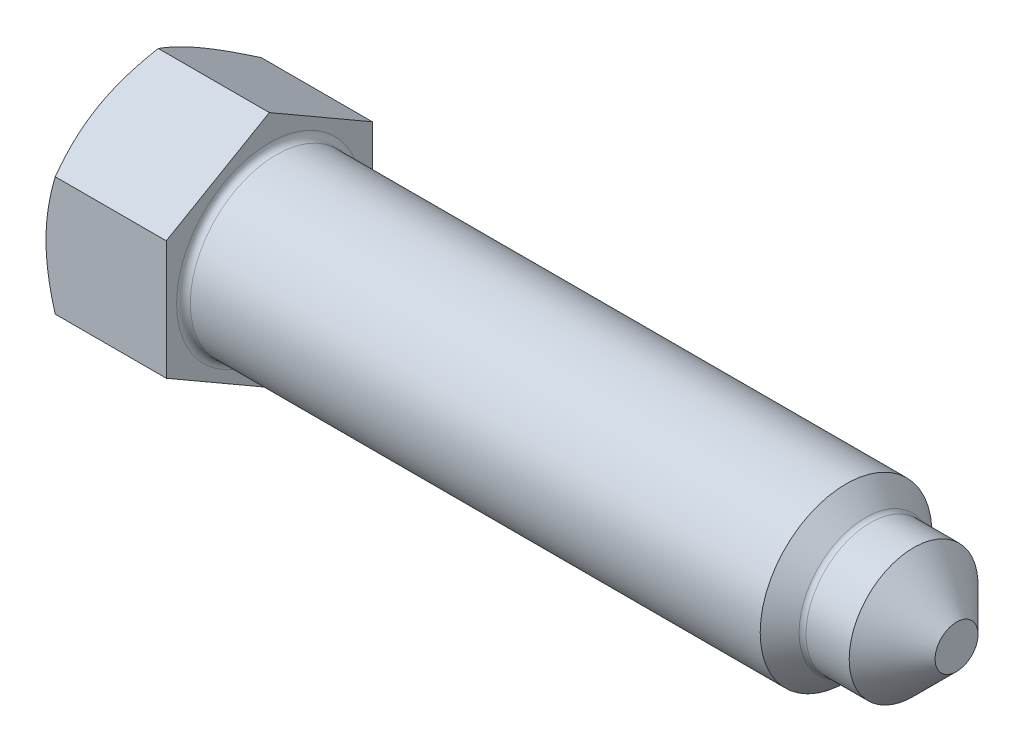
ISO-10303-21;
HEADER;
FILE_DESCRIPTION(('STEP AP214'),'2;1');
FILE_NAME('part.step','',(''),(''),'','','');
FILE_SCHEMA(('AUTOMOTIVE_DESIGN { 1 0 10303 214 1 1 1 1 }'));
ENDSEC;
DATA;
#1=APPLICATION_CONTEXT('core data for automotive mechanical design processes');
#2=APPLICATION_PROTOCOL_DEFINITION('international standard','automotive_design',2000,#1);
#3=PRODUCT_CONTEXT('',#1,'mechanical');
#4=PRODUCT('Part','Part','',(#3));
#5=PRODUCT_RELATED_PRODUCT_CATEGORY('part','',(#4));
#6=PRODUCT_DEFINITION_FORMATION('','',#4);
#7=PRODUCT_DEFINITION_CONTEXT('part definition',#1,'design');
#8=PRODUCT_DEFINITION('design','',#6,#7);
#9=PRODUCT_DEFINITION_SHAPE('','',#8);
#10=(LENGTH_UNIT() NAMED_UNIT(*) SI_UNIT(.MILLI.,.METRE.));
#11=(NAMED_UNIT(*) PLANE_ANGLE_UNIT() SI_UNIT($,.RADIAN.));
#12=(NAMED_UNIT(*) SI_UNIT($,.STERADIAN.) SOLID_ANGLE_UNIT());
#13=UNCERTAINTY_MEASURE_WITH_UNIT(LENGTH_MEASURE(1.E-05),#10,'distance_accuracy_value','');
#14=(GEOMETRIC_REPRESENTATION_CONTEXT(3) GLOBAL_UNCERTAINTY_ASSIGNED_CONTEXT((#13)) GLOBAL_UNIT_ASSIGNED_CONTEXT((#10,
#11,#12)) REPRESENTATION_CONTEXT('',''));
#15=CARTESIAN_POINT('',(0.,0.,0.));
#16=DIRECTION('',(0.,0.,1.));
#17=DIRECTION('',(1.,0.,0.));
#18=AXIS2_PLACEMENT_3D('',#15,#16,#17);
#19=CARTESIAN_POINT('',(14.,6.9282032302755,-12.));
#20=DIRECTION('',(0.,-0.866025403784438,0.500000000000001));
#21=DIRECTION('',(0.,-0.500000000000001,-0.866025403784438));
#22=AXIS2_PLACEMENT_3D('',#19,#20,#21);
#23=PLANE('',#22);
#24=CARTESIAN_POINT('',(1.07186343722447,13.8565219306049,0.0002));
#25=CARTESIAN_POINT('',(0.983949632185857,13.7042251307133,-0.263585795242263));
#26=CARTESIAN_POINT('',(0.900025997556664,13.5513604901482,-0.5283551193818));
#27=CARTESIAN_POINT('',(0.741266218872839,13.244405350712,-1.06001701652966));
#28=CARTESIAN_POINT('',(0.666433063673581,13.0903144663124,-1.32691025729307));
#29=CARTESIAN_POINT('',(0.457017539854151,12.6255589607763,-2.13189040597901));
#30=CARTESIAN_POINT('',(0.33790323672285,12.3130596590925,-2.6731550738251));
#31=CARTESIAN_POINT('',(0.198231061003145,11.8454187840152,-3.48313282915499));
#32=CARTESIAN_POINT('',(0.158443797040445,11.6916742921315,-3.74942610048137));
#33=CARTESIAN_POINT('',(0.091723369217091,11.3834734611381,-4.28324559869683));
#34=CARTESIAN_POINT('',(0.0647904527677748,11.2290171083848,-4.55077184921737));
#35=CARTESIAN_POINT('',(0.0244685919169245,10.9198468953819,-5.08627036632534));
#36=CARTESIAN_POINT('',(0.0110635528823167,10.7651335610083,-5.35424172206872));
#37=CARTESIAN_POINT('',(-0.00191690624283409,10.4555635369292,-5.89043273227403));
#38=CARTESIAN_POINT('',(-0.00149275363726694,10.3007068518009,-6.15865237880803));
#39=CARTESIAN_POINT('',(0.0122200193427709,10.011202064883,-6.6600893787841));
#40=CARTESIAN_POINT('',(0.0238359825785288,9.87653331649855,-6.89334249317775));
#41=CARTESIAN_POINT('',(0.0573080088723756,9.60750555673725,-7.35931224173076));
#42=CARTESIAN_POINT('',(0.0791647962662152,9.47314656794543,-7.59202883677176));
#43=CARTESIAN_POINT('',(0.132737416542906,9.20481134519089,-8.05679907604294));
#44=CARTESIAN_POINT('',(0.16446139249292,9.07083551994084,-8.288852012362));
#45=CARTESIAN_POINT('',(0.237211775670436,8.80351197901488,-8.75186996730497));
#46=CARTESIAN_POINT('',(0.278238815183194,8.67016430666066,-8.98283491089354));
#47=CARTESIAN_POINT('',(0.416311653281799,8.2653799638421,-9.68394195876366));
#48=CARTESIAN_POINT('',(0.52712488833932,7.99511549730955,-10.1520537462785));
#49=CARTESIAN_POINT('',(0.778625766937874,7.45861659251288,-11.0812971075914));
#50=CARTESIAN_POINT('',(0.919254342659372,7.19237528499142,-11.5424405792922));
#51=CARTESIAN_POINT('',(1.07186343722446,6.92808776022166,-12.0002));
#52=B_SPLINE_CURVE_WITH_KNOTS('',3,(#24,#25,#26,#27,#28,#29,#30,#31,#32,#33,#34,#35,#36,#37,#38,
#39,#40,#41,#42,#43,#44,#45,#46,#47,#48,#49,#50,#51),.UNSPECIFIED.,.F.,.F.,(4,2,2,2,2,2,2,2,2,2,
2,2,2,4),(0.,0.951004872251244,1.90232158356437,3.80900466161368,4.7389455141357,
5.66890426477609,6.59775529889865,7.5265776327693,8.33514643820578,9.14377244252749,
9.95306755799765,10.7624176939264,12.4167102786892,14.0677556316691),.UNSPECIFIED.);
#53=CARTESIAN_POINT('',(1.07179676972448,13.856406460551,0.));
#54=VERTEX_POINT('',#53);
#55=CARTESIAN_POINT('',(0.,10.3923048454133,-6.00000000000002));
#56=VERTEX_POINT('',#55);
#57=EDGE_CURVE('E48',#54,#56,#52,.T.);
#58=ORIENTED_EDGE('',*,*,#57,.F.);
#59=DIRECTION('',(-1.,0.,0.));
#60=VECTOR('',#59,1.);
#61=CARTESIAN_POINT('',(14.,13.856406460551,0.));
#62=LINE('',#61,#60);
#63=CARTESIAN_POINT('',(14.,13.856406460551,0.));
#64=VERTEX_POINT('',#63);
#65=EDGE_CURVE('E147',#64,#54,#62,.T.);
#66=ORIENTED_EDGE('',*,*,#65,.F.);
#67=DIRECTION('',(0.,0.500000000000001,0.866025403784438));
#68=VECTOR('',#67,1.);
#69=CARTESIAN_POINT('',(14.,6.9282032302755,-12.));
#70=LINE('',#69,#68);
#71=CARTESIAN_POINT('',(14.,6.9282032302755,-12.));
#72=VERTEX_POINT('',#71);
#73=EDGE_CURVE('E313',#72,#64,#70,.T.);
#74=ORIENTED_EDGE('',*,*,#73,.F.);
#75=DIRECTION('',(-1.,0.,0.));
#76=VECTOR('',#75,1.);
#77=CARTESIAN_POINT('',(14.,6.9282032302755,-12.));
#78=LINE('',#77,#76);
#79=CARTESIAN_POINT('',(1.07179676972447,6.9282032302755,-12.));
#80=VERTEX_POINT('',#79);
#81=EDGE_CURVE('E134',#72,#80,#78,.T.);
#82=ORIENTED_EDGE('',*,*,#81,.T.);
#83=EDGE_CURVE('E128',#56,#80,#52,.T.);
#84=ORIENTED_EDGE('',*,*,#83,.F.);
#85=EDGE_LOOP('',(#58,#66,#74,#82,#84));
#86=FACE_BOUND('',#85,.T.);
#87=ADVANCED_FACE('F33',(#86),#23,.F.);
#88=CARTESIAN_POINT('',(14.,13.856406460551,0.));
#89=DIRECTION('',(0.,-0.866025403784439,-0.5));
#90=DIRECTION('',(0.,0.5,-0.866025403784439));
#91=AXIS2_PLACEMENT_3D('',#88,#89,#90);
#92=PLANE('',#91);
#93=CARTESIAN_POINT('',(1.07186343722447,6.92808776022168,12.0002));
#94=CARTESIAN_POINT('',(0.983949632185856,7.0803845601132,11.7364142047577));
#95=CARTESIAN_POINT('',(0.900025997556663,7.23324920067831,11.4716448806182));
#96=CARTESIAN_POINT('',(0.741266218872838,7.5402043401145,10.9399829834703));
#97=CARTESIAN_POINT('',(0.666433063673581,7.69429522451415,10.6730897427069));
#98=CARTESIAN_POINT('',(0.457017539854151,8.15905073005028,9.86810959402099));
#99=CARTESIAN_POINT('',(0.337903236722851,8.47155003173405,9.3268449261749));
#100=CARTESIAN_POINT('',(0.198231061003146,8.93919090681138,8.51686717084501));
#101=CARTESIAN_POINT('',(0.158443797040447,9.09293539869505,8.25057389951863));
#102=CARTESIAN_POINT('',(0.0917233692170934,9.40113622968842,7.71675440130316));
#103=CARTESIAN_POINT('',(0.0647904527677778,9.55559258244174,7.44922815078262));
#104=CARTESIAN_POINT('',(0.024468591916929,9.86476279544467,6.91372963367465));
#105=CARTESIAN_POINT('',(0.0110635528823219,10.0194761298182,6.64575827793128));
#106=CARTESIAN_POINT('',(-0.00191690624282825,10.3290461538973,6.10956726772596));
#107=CARTESIAN_POINT('',(-0.00149275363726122,10.4839028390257,5.84134762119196));
#108=CARTESIAN_POINT('',(0.0122200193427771,10.7734076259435,5.3399106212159));
#109=CARTESIAN_POINT('',(0.0238359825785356,10.908076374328,5.10665750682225));
#110=CARTESIAN_POINT('',(0.057308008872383,11.1771041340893,4.64068775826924));
#111=CARTESIAN_POINT('',(0.0791647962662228,11.3114631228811,4.40797116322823));
#112=CARTESIAN_POINT('',(0.132737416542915,11.5797983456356,3.94320092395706));
#113=CARTESIAN_POINT('',(0.164461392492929,11.7137741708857,3.711147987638));
#114=CARTESIAN_POINT('',(0.237211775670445,11.9810977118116,3.24813003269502));
#115=CARTESIAN_POINT('',(0.278238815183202,12.1144453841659,3.01716508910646));
#116=CARTESIAN_POINT('',(0.416311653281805,12.5192297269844,2.31605804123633));
#117=CARTESIAN_POINT('',(0.527124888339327,12.789494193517,1.84794625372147));
#118=CARTESIAN_POINT('',(0.778625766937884,13.3259930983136,0.91870289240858));
#119=CARTESIAN_POINT('',(0.919254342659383,13.5922344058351,0.457559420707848));
#120=CARTESIAN_POINT('',(1.07186343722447,13.8565219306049,-0.000199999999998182));
#121=B_SPLINE_CURVE_WITH_KNOTS('',3,(#93,#94,#95,#96,#97,#98,#99,#100,#101,#102,#103,#104,#105,
#106,#107,#108,#109,#110,#111,#112,#113,#114,#115,#116,#117,#118,#119,#120),.UNSPECIFIED.,.F.,
.F.,(4,2,2,2,2,2,2,2,2,2,2,2,2,4),(0.,0.951004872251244,1.90232158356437,3.80900466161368,
4.7389455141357,5.66890426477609,6.59775529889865,7.5265776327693,8.33514643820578,
9.14377244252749,9.95306755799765,10.7624176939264,12.4167102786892,14.0677556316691),.UNSPECIFIED.);
#122=CARTESIAN_POINT('',(1.07179676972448,6.92820323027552,12.));
#123=VERTEX_POINT('',#122);
#124=CARTESIAN_POINT('',(0.,10.3923048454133,6.));
#125=VERTEX_POINT('',#124);
#126=EDGE_CURVE('E56',#123,#125,#121,.T.);
#127=ORIENTED_EDGE('',*,*,#126,.F.);
#128=DIRECTION('',(-1.,0.,0.));
#129=VECTOR('',#128,1.);
#130=CARTESIAN_POINT('',(14.,6.92820323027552,12.));
#131=LINE('',#130,#129);
#132=CARTESIAN_POINT('',(14.,6.92820323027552,12.));
#133=VERTEX_POINT('',#132);
#134=EDGE_CURVE('E144',#133,#123,#131,.T.);
#135=ORIENTED_EDGE('',*,*,#134,.F.);
#136=DIRECTION('',(0.,-0.5,0.866025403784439));
#137=VECTOR('',#136,1.);
#138=CARTESIAN_POINT('',(14.,13.856406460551,0.));
#139=LINE('',#138,#137);
#140=EDGE_CURVE('E299',#64,#133,#139,.T.);
#141=ORIENTED_EDGE('',*,*,#140,.F.);
#142=ORIENTED_EDGE('',*,*,#65,.T.);
#143=EDGE_CURVE('E226',#125,#54,#121,.T.);
#144=ORIENTED_EDGE('',*,*,#143,.F.);
#145=EDGE_LOOP('',(#127,#135,#141,#142,#144));
#146=FACE_BOUND('',#145,.T.);
#147=ADVANCED_FACE('F174',(#146),#92,.F.);
#148=CARTESIAN_POINT('',(14.,6.92820323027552,12.));
#149=DIRECTION('',(0.,0.,-1.));
#150=DIRECTION('',(-1.,0.,0.));
#151=AXIS2_PLACEMENT_3D('',#148,#149,#150);
#152=PLANE('',#151);
#153=CARTESIAN_POINT('',(5.93796522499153,-18.7780422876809,12.));
#154=CARTESIAN_POINT('',(5.81013580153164,-18.5152821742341,12.));
#155=CARTESIAN_POINT('',(5.68293119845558,-18.2522182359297,12.));
#156=CARTESIAN_POINT('',(5.4299128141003,-17.7254193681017,12.));
#157=CARTESIAN_POINT('',(5.30409904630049,-17.4616844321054,12.));
#158=CARTESIAN_POINT('',(4.92892368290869,-16.6693101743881,12.));
#159=CARTESIAN_POINT('',(4.68186469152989,-16.1395765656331,12.));
#160=CARTESIAN_POINT('',(4.19405479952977,-15.0738169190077,12.));
#161=CARTESIAN_POINT('',(3.95334413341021,-14.5377724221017,12.));
#162=CARTESIAN_POINT('',(3.48154718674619,-13.461479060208,12.));
#163=CARTESIAN_POINT('',(3.25046046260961,-12.9212303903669,12.));
#164=CARTESIAN_POINT('',(2.79294900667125,-11.8175688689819,12.));
#165=CARTESIAN_POINT('',(2.56693655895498,-11.2539842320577,12.));
#166=CARTESIAN_POINT('',(2.1316128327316,-10.1202797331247,12.));
#167=CARTESIAN_POINT('',(1.92230340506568,-9.55015915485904,12.));
#168=CARTESIAN_POINT('',(1.52576124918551,-8.40350794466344,12.));
#169=CARTESIAN_POINT('',(1.33848523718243,-7.82699240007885,12.));
#170=CARTESIAN_POINT('',(0.991896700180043,-6.66563869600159,12.));
#171=CARTESIAN_POINT('',(0.832575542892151,-6.08080316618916,12.));
#172=CARTESIAN_POINT('',(0.620681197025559,-5.19882791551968,12.));
#173=CARTESIAN_POINT('',(0.554713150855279,-4.90488790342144,12.));
#174=CARTESIAN_POINT('',(0.432574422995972,-4.31496880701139,12.));
#175=CARTESIAN_POINT('',(0.376403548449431,-4.01898976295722,12.));
#176=CARTESIAN_POINT('',(0.274840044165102,-3.42518449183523,12.));
#177=CARTESIAN_POINT('',(0.229447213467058,-3.12735829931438,12.));
#178=CARTESIAN_POINT('',(0.150338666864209,-2.5301603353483,12.));
#179=CARTESIAN_POINT('',(0.116622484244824,-2.23078862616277,12.));
#180=CARTESIAN_POINT('',(0.0619693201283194,-1.63489952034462,12.));
#181=CARTESIAN_POINT('',(0.0408679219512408,-1.33839729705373,12.));
#182=CARTESIAN_POINT('',(0.011231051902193,-0.744766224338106,12.));
#183=CARTESIAN_POINT('',(0.00269536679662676,-0.447637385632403,12.));
#184=CARTESIAN_POINT('',(-0.00160621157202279,0.146715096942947,12.));
#185=CARTESIAN_POINT('',(0.00262788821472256,0.443938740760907,12.));
#186=CARTESIAN_POINT('',(0.0237602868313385,1.03793867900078,12.));
#187=CARTESIAN_POINT('',(0.0406591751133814,1.33471495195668,12.));
#188=CARTESIAN_POINT('',(0.0957363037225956,2.04293812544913,12.));
#189=CARTESIAN_POINT('',(0.139644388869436,2.45394931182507,12.));
#190=CARTESIAN_POINT('',(0.249393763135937,3.27301119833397,12.));
#191=CARTESIAN_POINT('',(0.315237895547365,3.68106150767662,12.));
#192=CARTESIAN_POINT('',(0.542190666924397,4.90025554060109,12.));
#193=CARTESIAN_POINT('',(0.732681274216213,5.70600726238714,12.));
#194=CARTESIAN_POINT('',(1.06415793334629,6.9110176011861,12.));
#195=CARTESIAN_POINT('',(1.18384338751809,7.31649624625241,12.));
#196=CARTESIAN_POINT('',(1.43593551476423,8.12351840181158,12.));
#197=CARTESIAN_POINT('',(1.56834227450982,8.52506188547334,12.));
#198=CARTESIAN_POINT('',(1.84372865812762,9.32433402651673,12.));
#199=CARTESIAN_POINT('',(1.98670500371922,9.72206382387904,12.));
#200=CARTESIAN_POINT('',(2.28151949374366,10.514209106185,12.));
#201=CARTESIAN_POINT('',(2.43335751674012,10.9086246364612,12.));
#202=CARTESIAN_POINT('',(2.81137815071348,11.8636440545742,12.));
#203=CARTESIAN_POINT('',(3.04143185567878,12.4227131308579,12.));
#204=CARTESIAN_POINT('',(3.51333410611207,13.5358669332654,12.));
#205=CARTESIAN_POINT('',(3.75518348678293,14.0899513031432,12.));
#206=CARTESIAN_POINT('',(4.24823475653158,15.1941025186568,12.));
#207=CARTESIAN_POINT('',(4.49943904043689,15.7441682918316,12.));
#208=CARTESIAN_POINT('',(5.00924552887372,16.840834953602,12.));
#209=CARTESIAN_POINT('',(5.26784754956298,17.38743592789,12.));
#210=CARTESIAN_POINT('',(5.79133879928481,18.4784293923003,12.));
#211=CARTESIAN_POINT('',(6.05623527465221,19.0228183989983,12.));
#212=CARTESIAN_POINT('',(6.59090796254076,20.1091945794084,12.));
#213=CARTESIAN_POINT('',(6.86068419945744,20.651181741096,12.));
#214=CARTESIAN_POINT('',(7.40421496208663,21.7330545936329,12.));
#215=CARTESIAN_POINT('',(7.67796889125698,22.2729405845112,12.));
#216=CARTESIAN_POINT('',(8.22882461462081,23.351002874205,12.));
#217=CARTESIAN_POINT('',(8.50592642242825,23.8891791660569,12.));
#218=CARTESIAN_POINT('',(9.29226596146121,25.4066579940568,12.));
#219=CARTESIAN_POINT('',(9.8047565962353,26.3842748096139,12.));
#220=CARTESIAN_POINT('',(10.8366490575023,28.3358962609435,12.));
#221=CARTESIAN_POINT('',(11.3560511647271,29.3099007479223,12.));
#222=CARTESIAN_POINT('',(12.3986980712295,31.2524398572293,12.));
#223=CARTESIAN_POINT('',(12.9219285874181,32.2209821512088,12.));
#224=CARTESIAN_POINT('',(13.709817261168,33.6721037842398,12.));
#225=CARTESIAN_POINT('',(13.9729461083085,34.1555146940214,12.));
#226=CARTESIAN_POINT('',(14.5001155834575,35.1218381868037,12.));
#227=CARTESIAN_POINT('',(14.7641562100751,35.6047507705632,12.));
#228=CARTESIAN_POINT('',(15.0285993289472,36.087442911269,12.));
#229=B_SPLINE_CURVE_WITH_KNOTS('',3,(#153,#154,#155,#156,#157,#158,#159,#160,#161,#162,#163,
#164,#165,#166,#167,#168,#169,#170,#171,#172,#173,#174,#175,#176,#177,#178,#179,#180,#181,#182,
#183,#184,#185,#186,#187,#188,#189,#190,#191,#192,#193,#194,#195,#196,#197,#198,#199,#200,#201,
#202,#203,#204,#205,#206,#207,#208,#209,#210,#211,#212,#213,#214,#215,#216,#217,#218,#219,#220,
#221,#222,#223,#224,#225,#226,#227,#228),.UNSPECIFIED.,.F.,.F.,(4,2,2,2,2,2,2,2,2,2,2,2,2,2,2,2,
2,2,2,2,2,2,2,2,2,2,2,2,2,2,2,2,2,2,2,2,2,4),(0.,0.876610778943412,1.75323004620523,
3.50671945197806,5.26947518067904,7.03214956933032,8.85359042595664,10.6752328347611,
12.4932347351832,14.3106742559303,15.2142921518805,16.117892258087,17.0214755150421,
17.9250226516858,18.8165208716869,19.7080039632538,20.5994865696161,21.4910106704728,
22.7303633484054,23.9698767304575,26.4502079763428,27.7184187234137,28.9866381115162,
30.2544657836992,31.5222760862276,33.3357454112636,35.1493433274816,36.9634087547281,
38.7774291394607,40.5936500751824,42.4098800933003,44.2258404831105,46.0418082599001,
49.3531754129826,52.664677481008,55.9671781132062,57.6183303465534,59.2694800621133),.UNSPECIFIED.);
#230=CARTESIAN_POINT('',(1.07179676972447,-6.92820323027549,12.));
#231=VERTEX_POINT('',#230);
#232=CARTESIAN_POINT('',(0.,0.,12.));
#233=VERTEX_POINT('',#232);
#234=EDGE_CURVE('E237',#231,#233,#229,.T.);
#235=ORIENTED_EDGE('',*,*,#234,.F.);
#236=DIRECTION('',(-1.,0.,0.));
#237=VECTOR('',#236,1.);
#238=CARTESIAN_POINT('',(14.,-6.92820323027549,12.));
#239=LINE('',#238,#237);
#240=CARTESIAN_POINT('',(14.,-6.92820323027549,12.));
#241=VERTEX_POINT('',#240);
#242=EDGE_CURVE('E136',#241,#231,#239,.T.);
#243=ORIENTED_EDGE('',*,*,#242,.F.);
#244=DIRECTION('',(0.,-1.,0.));
#245=VECTOR('',#244,1.);
#246=CARTESIAN_POINT('',(14.,6.92820323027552,12.));
#247=LINE('',#246,#245);
#248=EDGE_CURVE('E298',#133,#241,#247,.T.);
#249=ORIENTED_EDGE('',*,*,#248,.F.);
#250=ORIENTED_EDGE('',*,*,#134,.T.);
#251=EDGE_CURVE('E231',#233,#123,#229,.T.);
#252=ORIENTED_EDGE('',*,*,#251,.F.);
#253=EDGE_LOOP('',(#235,#243,#249,#250,#252));
#254=FACE_BOUND('',#253,.T.);
#255=ADVANCED_FACE('F180',(#254),#152,.F.);
#256=CARTESIAN_POINT('',(14.,-13.856406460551,0.));
#257=DIRECTION('',(0.,0.866025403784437,-0.500000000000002));
#258=DIRECTION('',(0.,0.500000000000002,0.866025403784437));
#259=AXIS2_PLACEMENT_3D('',#256,#257,#258);
#260=PLANE('',#259);
#261=CARTESIAN_POINT('',(1.07186343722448,-13.8565219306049,-0.000200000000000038));
#262=CARTESIAN_POINT('',(0.983949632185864,-13.7042251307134,0.263585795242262));
#263=CARTESIAN_POINT('',(0.900025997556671,-13.5513604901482,0.528355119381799));
#264=CARTESIAN_POINT('',(0.741266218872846,-13.2444053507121,1.06001701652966));
#265=CARTESIAN_POINT('',(0.666433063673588,-13.0903144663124,1.32691025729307));
#266=CARTESIAN_POINT('',(0.457017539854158,-12.6255589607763,2.13189040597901));
#267=CARTESIAN_POINT('',(0.337903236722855,-12.3130596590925,2.6731550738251));
#268=CARTESIAN_POINT('',(0.198231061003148,-11.8454187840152,3.48313282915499));
#269=CARTESIAN_POINT('',(0.158443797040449,-11.6916742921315,3.74942610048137));
#270=CARTESIAN_POINT('',(0.0917233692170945,-11.3834734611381,4.28324559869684));
#271=CARTESIAN_POINT('',(0.0647904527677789,-11.2290171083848,4.55077184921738));
#272=CARTESIAN_POINT('',(0.0244685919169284,-10.9198468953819,5.08627036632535));
#273=CARTESIAN_POINT('',(0.0110635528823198,-10.7651335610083,5.35424172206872));
#274=CARTESIAN_POINT('',(-0.00191690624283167,-10.4555635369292,5.89043273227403));
#275=CARTESIAN_POINT('',(-0.0014927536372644,-10.3007068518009,6.15865237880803));
#276=CARTESIAN_POINT('',(0.0122200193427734,-10.0112020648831,6.6600893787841));
#277=CARTESIAN_POINT('',(0.0238359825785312,-9.87653331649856,6.89334249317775));
#278=CARTESIAN_POINT('',(0.0573080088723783,-9.60750555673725,7.35931224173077));
#279=CARTESIAN_POINT('',(0.0791647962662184,-9.47314656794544,7.59202883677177));
#280=CARTESIAN_POINT('',(0.132737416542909,-9.2048113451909,8.05679907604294));
#281=CARTESIAN_POINT('',(0.164461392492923,-9.07083551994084,8.288852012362));
#282=CARTESIAN_POINT('',(0.237211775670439,-8.80351197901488,8.75186996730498));
#283=CARTESIAN_POINT('',(0.278238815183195,-8.67016430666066,8.98283491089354));
#284=CARTESIAN_POINT('',(0.416311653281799,-8.2653799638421,9.68394195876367));
#285=CARTESIAN_POINT('',(0.52712488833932,-7.99511549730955,10.1520537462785));
#286=CARTESIAN_POINT('',(0.778625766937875,-7.45861659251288,11.0812971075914));
#287=CARTESIAN_POINT('',(0.919254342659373,-7.19237528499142,11.5424405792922));
#288=CARTESIAN_POINT('',(1.07186343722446,-6.92808776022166,12.0002));
#289=B_SPLINE_CURVE_WITH_KNOTS('',3,(#261,#262,#263,#264,#265,#266,#267,#268,#269,#270,#271,
#272,#273,#274,#275,#276,#277,#278,#279,#280,#281,#282,#283,#284,#285,#286,#287,#288),
.UNSPECIFIED.,.F.,.F.,(4,2,2,2,2,2,2,2,2,2,2,2,2,4),(0.,0.951004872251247,1.90232158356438,
3.80900466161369,4.7389455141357,5.66890426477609,6.59775529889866,7.52657763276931,
8.33514643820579,9.1437724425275,9.95306755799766,10.7624176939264,12.4167102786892,
14.0677556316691),.UNSPECIFIED.);
#290=CARTESIAN_POINT('',(1.07179676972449,-13.856406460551,0.));
#291=VERTEX_POINT('',#290);
#292=CARTESIAN_POINT('',(0.,-10.3923048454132,6.00000000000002));
#293=VERTEX_POINT('',#292);
#294=EDGE_CURVE('E198',#291,#293,#289,.T.);
#295=ORIENTED_EDGE('',*,*,#294,.F.);
#296=DIRECTION('',(-1.,0.,0.));
#297=VECTOR('',#296,1.);
#298=CARTESIAN_POINT('',(14.,-13.856406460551,0.));
#299=LINE('',#298,#297);
#300=CARTESIAN_POINT('',(14.,-13.856406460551,0.));
#301=VERTEX_POINT('',#300);
#302=EDGE_CURVE('E133',#301,#291,#299,.T.);
#303=ORIENTED_EDGE('',*,*,#302,.F.);
#304=DIRECTION('',(0.,-0.500000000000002,-0.866025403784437));
#305=VECTOR('',#304,1.);
#306=CARTESIAN_POINT('',(14.,-13.856406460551,0.));
#307=LINE('',#306,#305);
#308=EDGE_CURVE('E307',#241,#301,#307,.T.);
#309=ORIENTED_EDGE('',*,*,#308,.F.);
#310=ORIENTED_EDGE('',*,*,#242,.T.);
#311=EDGE_CURVE('E238',#293,#231,#289,.T.);
#312=ORIENTED_EDGE('',*,*,#311,.F.);
#313=EDGE_LOOP('',(#295,#303,#309,#310,#312));
#314=FACE_BOUND('',#313,.T.);
#315=ADVANCED_FACE('F243',(#314),#260,.F.);
#316=CARTESIAN_POINT('',(14.,-6.92820323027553,-12.));
#317=DIRECTION('',(0.,0.866025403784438,0.5));
#318=DIRECTION('',(0.,-0.5,0.866025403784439));
#319=AXIS2_PLACEMENT_3D('',#316,#317,#318);
#320=PLANE('',#319);
#321=CARTESIAN_POINT('',(1.07186343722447,-6.92808776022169,-12.0002));
#322=CARTESIAN_POINT('',(0.983949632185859,-7.08038456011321,-11.7364142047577));
#323=CARTESIAN_POINT('',(0.900025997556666,-7.23324920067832,-11.4716448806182));
#324=CARTESIAN_POINT('',(0.741266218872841,-7.54020434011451,-10.9399829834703));
#325=CARTESIAN_POINT('',(0.666433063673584,-7.69429522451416,-10.6730897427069));
#326=CARTESIAN_POINT('',(0.457017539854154,-8.15905073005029,-9.86810959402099));
#327=CARTESIAN_POINT('',(0.337903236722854,-8.47155003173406,-9.3268449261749));
#328=CARTESIAN_POINT('',(0.198231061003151,-8.93919090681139,-8.516867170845));
#329=CARTESIAN_POINT('',(0.158443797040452,-9.09293539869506,-8.25057389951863));
#330=CARTESIAN_POINT('',(0.0917233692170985,-9.40113622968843,-7.71675440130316));
#331=CARTESIAN_POINT('',(0.0647904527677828,-9.55559258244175,-7.44922815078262));
#332=CARTESIAN_POINT('',(0.024468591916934,-9.86476279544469,-6.91372963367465));
#333=CARTESIAN_POINT('',(0.011063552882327,-10.0194761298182,-6.64575827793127));
#334=CARTESIAN_POINT('',(-0.00191690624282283,-10.3290461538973,-6.10956726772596));
#335=CARTESIAN_POINT('',(-0.00149275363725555,-10.4839028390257,-5.84134762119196));
#336=CARTESIAN_POINT('',(0.0122200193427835,-10.7734076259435,-5.3399106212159));
#337=CARTESIAN_POINT('',(0.0238359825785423,-10.908076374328,-5.10665750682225));
#338=CARTESIAN_POINT('',(0.0573080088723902,-11.1771041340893,-4.64068775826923));
#339=CARTESIAN_POINT('',(0.07916479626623,-11.3114631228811,-4.40797116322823));
#340=CARTESIAN_POINT('',(0.132737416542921,-11.5797983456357,-3.94320092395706));
#341=CARTESIAN_POINT('',(0.164461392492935,-11.7137741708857,-3.711147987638));
#342=CARTESIAN_POINT('',(0.237211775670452,-11.9810977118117,-3.24813003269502));
#343=CARTESIAN_POINT('',(0.278238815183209,-12.1144453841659,-3.01716508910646));
#344=CARTESIAN_POINT('',(0.416311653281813,-12.5192297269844,-2.31605804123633));
#345=CARTESIAN_POINT('',(0.527124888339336,-12.789494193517,-1.84794625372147));
#346=CARTESIAN_POINT('',(0.778625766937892,-13.3259930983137,-0.918702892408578));
#347=CARTESIAN_POINT('',(0.91925434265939,-13.5922344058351,-0.457559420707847));
#348=CARTESIAN_POINT('',(1.07186343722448,-13.8565219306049,0.000199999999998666));
#349=B_SPLINE_CURVE_WITH_KNOTS('',3,(#321,#322,#323,#324,#325,#326,#327,#328,#329,#330,#331,
#332,#333,#334,#335,#336,#337,#338,#339,#340,#341,#342,#343,#344,#345,#346,#347,#348),
.UNSPECIFIED.,.F.,.F.,(4,2,2,2,2,2,2,2,2,2,2,2,2,4),(0.,0.951004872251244,1.90232158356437,
3.80900466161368,4.7389455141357,5.66890426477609,6.59775529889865,7.5265776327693,
8.33514643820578,9.14377244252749,9.95306755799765,10.7624176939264,12.4167102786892,
14.0677556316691),.UNSPECIFIED.);
#350=CARTESIAN_POINT('',(1.07179676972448,-6.92820323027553,-12.));
#351=VERTEX_POINT('',#350);
#352=CARTESIAN_POINT('',(0.,-10.3923048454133,-6.));
#353=VERTEX_POINT('',#352);
#354=EDGE_CURVE('E109',#351,#353,#349,.T.);
#355=ORIENTED_EDGE('',*,*,#354,.F.);
#356=DIRECTION('',(-1.,0.,0.));
#357=VECTOR('',#356,1.);
#358=CARTESIAN_POINT('',(14.,-6.92820323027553,-12.));
#359=LINE('',#358,#357);
#360=CARTESIAN_POINT('',(14.,-6.92820323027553,-12.));
#361=VERTEX_POINT('',#360);
#362=EDGE_CURVE('E124',#361,#351,#359,.T.);
#363=ORIENTED_EDGE('',*,*,#362,.F.);
#364=DIRECTION('',(0.,0.5,-0.866025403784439));
#365=VECTOR('',#364,1.);
#366=CARTESIAN_POINT('',(14.,-6.92820323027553,-12.));
#367=LINE('',#366,#365);
#368=EDGE_CURVE('E305',#301,#361,#367,.T.);
#369=ORIENTED_EDGE('',*,*,#368,.F.);
#370=ORIENTED_EDGE('',*,*,#302,.T.);
#371=EDGE_CURVE('E127',#353,#291,#349,.T.);
#372=ORIENTED_EDGE('',*,*,#371,.F.);
#373=EDGE_LOOP('',(#355,#363,#369,#370,#372));
#374=FACE_BOUND('',#373,.T.);
#375=ADVANCED_FACE('F122',(#374),#320,.F.);
#376=CARTESIAN_POINT('',(14.,6.9282032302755,-12.));
#377=DIRECTION('',(0.,0.,1.));
#378=DIRECTION('',(0.,-1.,0.));
#379=AXIS2_PLACEMENT_3D('',#376,#377,#378);
#380=PLANE('',#379);
#381=CARTESIAN_POINT('',(5.93796522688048,-18.7780422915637,-12.));
#382=CARTESIAN_POINT('',(5.81013580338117,-18.5152821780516,-12.));
#383=CARTESIAN_POINT('',(5.68293120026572,-18.2522182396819,-12.));
#384=CARTESIAN_POINT('',(5.42991281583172,-17.7254193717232,-12.));
#385=CARTESIAN_POINT('',(5.30409904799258,-17.4616844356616,-12.));
#386=CARTESIAN_POINT('',(4.92892368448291,-16.669310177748,-12.));
#387=CARTESIAN_POINT('',(4.68186469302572,-16.139576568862,-12.));
#388=CARTESIAN_POINT('',(4.19405480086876,-15.0738169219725,-12.));
#389=CARTESIAN_POINT('',(3.95334413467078,-14.5377724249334,-12.));
#390=CARTESIAN_POINT('',(3.48154718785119,-13.4614790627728,-12.));
#391=CARTESIAN_POINT('',(3.25046046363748,-12.9212303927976,-12.));
#392=CARTESIAN_POINT('',(2.7929490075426,-11.8175688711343,-12.));
#393=CARTESIAN_POINT('',(2.56693655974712,-11.2539842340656,-12.));
#394=CARTESIAN_POINT('',(2.13161283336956,-10.1202797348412,-12.));
#395=CARTESIAN_POINT('',(1.92230340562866,-9.55015915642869,-12.));
#396=CARTESIAN_POINT('',(1.52576124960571,-8.40350794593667,-12.));
#397=CARTESIAN_POINT('',(1.33848523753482,-7.82699240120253,-12.));
#398=CARTESIAN_POINT('',(0.991896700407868,-6.66563869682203,-12.));
#399=CARTESIAN_POINT('',(0.83257554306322,-6.08080316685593,-12.));
#400=CARTESIAN_POINT('',(0.620681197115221,-5.19882791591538,-12.));
#401=CARTESIAN_POINT('',(0.554713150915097,-4.90488790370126,-12.));
#402=CARTESIAN_POINT('',(0.432574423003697,-4.3149688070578,-12.));
#403=CARTESIAN_POINT('',(0.376403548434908,-4.01898976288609,-12.));
#404=CARTESIAN_POINT('',(0.274840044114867,-3.42518449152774,-12.));
#405=CARTESIAN_POINT('',(0.229447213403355,-3.12735829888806,-12.));
#406=CARTESIAN_POINT('',(0.150338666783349,-2.53016033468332,-12.));
#407=CARTESIAN_POINT('',(0.116622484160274,-2.23078862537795,-12.));
#408=CARTESIAN_POINT('',(0.0619693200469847,-1.63489951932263,-12.));
#409=CARTESIAN_POINT('',(0.040867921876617,-1.33839729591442,-12.));
#410=CARTESIAN_POINT('',(0.0112310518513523,-0.744766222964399,-12.));
#411=CARTESIAN_POINT('',(0.00269536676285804,-0.447637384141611,-12.));
#412=CARTESIAN_POINT('',(-0.00160621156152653,0.146715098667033,-12.));
#413=CARTESIAN_POINT('',(0.00262788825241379,0.443938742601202,-12.));
#414=CARTESIAN_POINT('',(0.0237602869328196,1.03793868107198,-12.));
#415=CARTESIAN_POINT('',(0.0406591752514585,1.33471495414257,-12.));
#416=CARTESIAN_POINT('',(0.0957363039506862,2.04293812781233,-12.));
#417=CARTESIAN_POINT('',(0.139644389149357,2.45394931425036,-12.));
#418=CARTESIAN_POINT('',(0.249393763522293,3.27301120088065,-12.));
#419=CARTESIAN_POINT('',(0.315237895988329,3.68106151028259,-12.));
#420=CARTESIAN_POINT('',(0.542190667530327,4.90025554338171,-12.));
#421=CARTESIAN_POINT('',(0.732681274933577,5.70600726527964,-12.));
#422=CARTESIAN_POINT('',(1.06415793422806,6.91101760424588,-12.));
#423=CARTESIAN_POINT('',(1.18384338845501,7.3164962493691,-12.));
#424=CARTESIAN_POINT('',(1.43593551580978,8.12351840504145,-12.));
#425=CARTESIAN_POINT('',(1.56834227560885,8.52506188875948,-12.));
#426=CARTESIAN_POINT('',(1.8437286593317,9.32433402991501,-12.));
#427=CARTESIAN_POINT('',(1.98670500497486,9.72206382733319,-12.));
#428=CARTESIAN_POINT('',(2.28151949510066,10.5142091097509,-12.));
#429=CARTESIAN_POINT('',(2.43335751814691,10.9086246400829,-12.));
#430=CARTESIAN_POINT('',(2.81137815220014,11.863644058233,-12.));
#431=CARTESIAN_POINT('',(3.04143185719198,12.422713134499,-12.));
#432=CARTESIAN_POINT('',(3.51333410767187,13.5358669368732,-12.));
#433=CARTESIAN_POINT('',(3.7551834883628,14.0899513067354,-12.));
#434=CARTESIAN_POINT('',(4.24823475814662,15.1941025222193,-12.));
#435=CARTESIAN_POINT('',(4.49943904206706,15.7441682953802,-12.));
#436=CARTESIAN_POINT('',(5.00924553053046,16.8408349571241,-12.));
#437=CARTESIAN_POINT('',(5.26784755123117,17.3874359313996,-12.));
#438=CARTESIAN_POINT('',(5.79133880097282,18.4784293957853,-12.));
#439=CARTESIAN_POINT('',(6.05623527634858,19.0228184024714,-12.));
#440=CARTESIAN_POINT('',(6.59090796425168,20.1091945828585,-12.));
#441=CARTESIAN_POINT('',(6.86068420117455,20.6511817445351,-12.));
#442=CARTESIAN_POINT('',(7.40421496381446,21.7330545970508,-12.));
#443=CARTESIAN_POINT('',(7.67796889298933,22.2729405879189,-12.));
#444=CARTESIAN_POINT('',(8.2288246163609,23.3510028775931,-12.));
#445=CARTESIAN_POINT('',(8.50592642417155,23.8891791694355,-12.));
#446=CARTESIAN_POINT('',(9.29226596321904,25.4066579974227,-12.));
#447=CARTESIAN_POINT('',(9.80475659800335,26.3842748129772,-12.));
#448=CARTESIAN_POINT('',(10.8366490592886,28.3358962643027,-12.));
#449=CARTESIAN_POINT('',(11.3560511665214,29.3099007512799,-12.));
#450=CARTESIAN_POINT('',(12.3986980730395,31.252439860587,-12.));
#451=CARTESIAN_POINT('',(12.9219285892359,32.2209821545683,-12.));
#452=CARTESIAN_POINT('',(13.7098172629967,33.6721037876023,-12.));
#453=CARTESIAN_POINT('',(13.9729461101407,34.155514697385,-12.));
#454=CARTESIAN_POINT('',(14.5001155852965,35.1218381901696,-12.));
#455=CARTESIAN_POINT('',(14.7641562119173,35.6047507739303,-12.));
#456=CARTESIAN_POINT('',(15.0285993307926,36.0874429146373,-12.));
#457=B_SPLINE_CURVE_WITH_KNOTS('',3,(#381,#382,#383,#384,#385,#386,#387,#388,#389,#390,#391,
#392,#393,#394,#395,#396,#397,#398,#399,#400,#401,#402,#403,#404,#405,#406,#407,#408,#409,#410,
#411,#412,#413,#414,#415,#416,#417,#418,#419,#420,#421,#422,#423,#424,#425,#426,#427,#428,#429,
#430,#431,#432,#433,#434,#435,#436,#437,#438,#439,#440,#441,#442,#443,#444,#445,#446,#447,#448,
#449,#450,#451,#452,#453,#454,#455,#456),.UNSPECIFIED.,.F.,.F.,(4,2,2,2,2,2,2,2,2,2,2,2,2,2,2,2,
2,2,2,2,2,2,2,2,2,2,2,2,2,2,2,2,2,2,2,2,2,4),(0.,0.876610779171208,1.75323004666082,
3.50671945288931,5.26947518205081,7.03214957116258,8.85359042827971,10.6752328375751,
12.4932347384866,14.3106742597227,15.2142921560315,16.1178922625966,17.02147551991,
17.9250226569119,18.8165208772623,19.7080039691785,20.5994865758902,21.4910106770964,
22.7303633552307,23.9698767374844,26.4502079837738,27.7184187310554,28.9866381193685,
30.2544657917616,31.5222760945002,33.3357454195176,35.1493433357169,36.9634087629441,
38.7774291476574,40.5936500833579,42.4098801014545,44.2258404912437,46.0418082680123,
49.3531754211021,52.6646774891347,55.9671781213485,57.6183303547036,59.2694800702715),.UNSPECIFIED.);
#458=CARTESIAN_POINT('',(0.,0.,-12.));
#459=VERTEX_POINT('',#458);
#460=EDGE_CURVE('E116',#80,#459,#457,.F.);
#461=ORIENTED_EDGE('',*,*,#460,.F.);
#462=ORIENTED_EDGE('',*,*,#81,.F.);
#463=DIRECTION('',(0.,1.,0.));
#464=VECTOR('',#463,1.);
#465=CARTESIAN_POINT('',(14.,6.9282032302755,-12.));
#466=LINE('',#465,#464);
#467=EDGE_CURVE('E132',#361,#72,#466,.T.);
#468=ORIENTED_EDGE('',*,*,#467,.F.);
#469=ORIENTED_EDGE('',*,*,#362,.T.);
#470=EDGE_CURVE('E106',#459,#351,#457,.F.);
#471=ORIENTED_EDGE('',*,*,#470,.F.);
#472=EDGE_LOOP('',(#461,#462,#468,#469,#471));
#473=FACE_BOUND('',#472,.T.);
#474=ADVANCED_FACE('F130',(#473),#380,.F.);
#475=CARTESIAN_POINT('',(14.,0.,-24.));
#476=DIRECTION('',(1.,0.,0.));
#477=DIRECTION('',(0.,0.,-1.));
#478=AXIS2_PLACEMENT_3D('',#475,#476,#477);
#479=PLANE('',#478);
#480=CARTESIAN_POINT('',(14.,0.,0.));
#481=DIRECTION('',(1.,0.,0.));
#482=DIRECTION('',(0.,0.,-1.));
#483=AXIS2_PLACEMENT_3D('',#480,#481,#482);
#484=CIRCLE('',#483,10.8);
#485=CARTESIAN_POINT('',(14.,0.,-10.8));
#486=VERTEX_POINT('',#485);
#487=EDGE_CURVE('E153',#486,#486,#484,.F.);
#488=ORIENTED_EDGE('',*,*,#487,.T.);
#489=EDGE_LOOP('',(#488));
#490=FACE_BOUND('',#489,.T.);
#491=ORIENTED_EDGE('',*,*,#73,.T.);
#492=ORIENTED_EDGE('',*,*,#140,.T.);
#493=ORIENTED_EDGE('',*,*,#248,.T.);
#494=ORIENTED_EDGE('',*,*,#308,.T.);
#495=ORIENTED_EDGE('',*,*,#368,.T.);
#496=ORIENTED_EDGE('',*,*,#467,.T.);
#497=EDGE_LOOP('',(#491,#492,#493,#494,#495,#496));
#498=FACE_BOUND('',#497,.T.);
#499=ADVANCED_FACE('F253',(#490,#498),#479,.T.);
#500=CARTESIAN_POINT('',(0.,0.,0.));
#501=DIRECTION('',(-1.,0.,0.));
#502=DIRECTION('',(0.,0.,1.));
#503=AXIS2_PLACEMENT_3D('',#500,#501,#502);
#504=CYLINDRICAL_SURFACE('',#503,10.);
#505=CARTESIAN_POINT('',(14.8,0.,0.));
#506=DIRECTION('',(1.,0.,0.));
#507=DIRECTION('',(0.,0.,-1.));
#508=AXIS2_PLACEMENT_3D('',#505,#506,#507);
#509=CIRCLE('',#508,10.);
#510=CARTESIAN_POINT('',(14.8,0.,-10.));
#511=VERTEX_POINT('',#510);
#512=EDGE_CURVE('E156',#511,#511,#509,.T.);
#513=ORIENTED_EDGE('',*,*,#512,.T.);
#514=EDGE_LOOP('',(#513));
#515=FACE_BOUND('',#514,.T.);
#516=CARTESIAN_POINT('',(81.14,0.,0.));
#517=DIRECTION('',(-1.,0.,0.));
#518=DIRECTION('',(0.,0.,1.));
#519=AXIS2_PLACEMENT_3D('',#516,#517,#518);
#520=CIRCLE('',#519,10.);
#521=CARTESIAN_POINT('',(81.14,0.,10.));
#522=VERTEX_POINT('',#521);
#523=EDGE_CURVE('E283',#522,#522,#520,.T.);
#524=ORIENTED_EDGE('',*,*,#523,.T.);
#525=EDGE_LOOP('',(#524));
#526=FACE_BOUND('',#525,.T.);
#527=ADVANCED_FACE('F260',(#515,#526),#504,.T.);
#528=CARTESIAN_POINT('',(83.64,0.,0.));
#529=DIRECTION('',(-1.,0.,0.));
#530=DIRECTION('',(0.,0.,1.));
#531=AXIS2_PLACEMENT_3D('',#528,#529,#530);
#532=CONICAL_SURFACE('',#531,7.50000000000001,0.785398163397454);
#533=CARTESIAN_POINT('',(83.4056854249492,0.,0.));
#534=DIRECTION('',(-1.,0.,0.));
#535=DIRECTION('',(0.,0.,1.));
#536=AXIS2_PLACEMENT_3D('',#533,#534,#535);
#537=CIRCLE('',#536,7.73431457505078);
#538=CARTESIAN_POINT('',(83.4056854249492,0.,7.73431457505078));
#539=VERTEX_POINT('',#538);
#540=EDGE_CURVE('E41',#539,#539,#537,.T.);
#541=ORIENTED_EDGE('',*,*,#540,.T.);
#542=EDGE_LOOP('',(#541));
#543=FACE_BOUND('',#542,.T.);
#544=ORIENTED_EDGE('',*,*,#523,.F.);
#545=EDGE_LOOP('',(#544));
#546=FACE_BOUND('',#545,.T.);
#547=ADVANCED_FACE('F161',(#543,#546),#532,.T.);
#548=CARTESIAN_POINT('',(0.,0.,0.));
#549=DIRECTION('',(-1.,0.,0.));
#550=DIRECTION('',(0.,0.,1.));
#551=AXIS2_PLACEMENT_3D('',#548,#549,#550);
#552=CYLINDRICAL_SURFACE('',#551,7.50000000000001);
#553=CARTESIAN_POINT('',(83.9713708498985,0.,0.));
#554=DIRECTION('',(-1.,0.,0.));
#555=DIRECTION('',(0.,0.,1.));
#556=AXIS2_PLACEMENT_3D('',#553,#554,#555);
#557=CIRCLE('',#556,7.50000000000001);
#558=CARTESIAN_POINT('',(83.9713708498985,0.,7.50000000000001));
#559=VERTEX_POINT('',#558);
#560=EDGE_CURVE('E11',#559,#559,#557,.F.);
#561=ORIENTED_EDGE('',*,*,#560,.T.);
#562=EDGE_LOOP('',(#561));
#563=FACE_BOUND('',#562,.T.);
#564=CARTESIAN_POINT('',(89.,0.,0.));
#565=DIRECTION('',(-1.,0.,0.));
#566=DIRECTION('',(0.,0.,1.));
#567=AXIS2_PLACEMENT_3D('',#564,#565,#566);
#568=CIRCLE('',#567,7.50000000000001);
#569=CARTESIAN_POINT('',(89.,0.,7.50000000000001));
#570=VERTEX_POINT('',#569);
#571=EDGE_CURVE('E280',#570,#570,#568,.T.);
#572=ORIENTED_EDGE('',*,*,#571,.T.);
#573=EDGE_LOOP('',(#572));
#574=FACE_BOUND('',#573,.T.);
#575=ADVANCED_FACE('F267',(#563,#574),#552,.T.);
#576=CARTESIAN_POINT('',(94.,0.,0.));
#577=DIRECTION('',(-1.,0.,0.));
#578=DIRECTION('',(0.,0.,1.));
#579=AXIS2_PLACEMENT_3D('',#576,#577,#578);
#580=CONICAL_SURFACE('',#579,2.49999999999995,0.785398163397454);
#581=CARTESIAN_POINT('',(94.,0.,0.));
#582=DIRECTION('',(-1.,0.,0.));
#583=DIRECTION('',(0.,0.,1.));
#584=AXIS2_PLACEMENT_3D('',#581,#582,#583);
#585=CIRCLE('',#584,2.49999999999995);
#586=CARTESIAN_POINT('',(94.,0.,2.49999999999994));
#587=VERTEX_POINT('',#586);
#588=EDGE_CURVE('E239',#587,#587,#585,.T.);
#589=CARTESIAN_POINT('',(89.,0.,7.50000000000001));
#590=CARTESIAN_POINT('',(89.0520833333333,0.,7.44791666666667));
#591=CARTESIAN_POINT('',(89.1041666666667,0.,7.39583333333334));
#592=CARTESIAN_POINT('',(89.2083333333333,0.,7.29166666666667));
#593=CARTESIAN_POINT('',(89.2604166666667,0.,7.23958333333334));
#594=CARTESIAN_POINT('',(89.3645833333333,0.,7.13541666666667));
#595=CARTESIAN_POINT('',(89.4166666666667,0.,7.08333333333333));
#596=CARTESIAN_POINT('',(89.5208333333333,0.,6.97916666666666));
#597=CARTESIAN_POINT('',(89.5729166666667,0.,6.92708333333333));
#598=CARTESIAN_POINT('',(89.6770833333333,0.,6.82291666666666));
#599=CARTESIAN_POINT('',(89.7291666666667,0.,6.77083333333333));
#600=CARTESIAN_POINT('',(89.8333333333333,0.,6.66666666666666));
#601=CARTESIAN_POINT('',(89.8854166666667,0.,6.61458333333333));
#602=CARTESIAN_POINT('',(89.9895833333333,0.,6.51041666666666));
#603=CARTESIAN_POINT('',(90.0416666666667,0.,6.45833333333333));
#604=CARTESIAN_POINT('',(90.1458333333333,0.,6.35416666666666));
#605=CARTESIAN_POINT('',(90.1979166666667,0.,6.30208333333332));
#606=CARTESIAN_POINT('',(90.3020833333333,0.,6.19791666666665));
#607=CARTESIAN_POINT('',(90.3541666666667,0.,6.14583333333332));
#608=CARTESIAN_POINT('',(90.4583333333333,0.,6.04166666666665));
#609=CARTESIAN_POINT('',(90.5104166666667,0.,5.98958333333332));
#610=CARTESIAN_POINT('',(90.6145833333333,0.,5.88541666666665));
#611=CARTESIAN_POINT('',(90.6666666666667,0.,5.83333333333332));
#612=CARTESIAN_POINT('',(90.7708333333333,0.,5.72916666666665));
#613=CARTESIAN_POINT('',(90.8229166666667,0.,5.67708333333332));
#614=CARTESIAN_POINT('',(90.9270833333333,0.,5.57291666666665));
#615=CARTESIAN_POINT('',(90.9791666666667,0.,5.52083333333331));
#616=CARTESIAN_POINT('',(91.0833333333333,0.,5.41666666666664));
#617=CARTESIAN_POINT('',(91.1354166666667,0.,5.36458333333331));
#618=CARTESIAN_POINT('',(91.2395833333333,0.,5.26041666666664));
#619=CARTESIAN_POINT('',(91.2916666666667,0.,5.20833333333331));
#620=CARTESIAN_POINT('',(91.3958333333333,0.,5.10416666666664));
#621=CARTESIAN_POINT('',(91.4479166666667,0.,5.05208333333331));
#622=CARTESIAN_POINT('',(91.5520833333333,0.,4.94791666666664));
#623=CARTESIAN_POINT('',(91.6041666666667,0.,4.89583333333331));
#624=CARTESIAN_POINT('',(91.7083333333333,0.,4.79166666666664));
#625=CARTESIAN_POINT('',(91.7604166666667,0.,4.7395833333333));
#626=CARTESIAN_POINT('',(91.8645833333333,0.,4.63541666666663));
#627=CARTESIAN_POINT('',(91.9166666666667,0.,4.5833333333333));
#628=CARTESIAN_POINT('',(92.0208333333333,0.,4.47916666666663));
#629=CARTESIAN_POINT('',(92.0729166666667,0.,4.4270833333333));
#630=CARTESIAN_POINT('',(92.1770833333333,0.,4.32291666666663));
#631=CARTESIAN_POINT('',(92.2291666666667,0.,4.2708333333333));
#632=CARTESIAN_POINT('',(92.3333333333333,0.,4.16666666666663));
#633=CARTESIAN_POINT('',(92.3854166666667,0.,4.11458333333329));
#634=CARTESIAN_POINT('',(92.4895833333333,0.,4.01041666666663));
#635=CARTESIAN_POINT('',(92.5416666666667,0.,3.95833333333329));
#636=CARTESIAN_POINT('',(92.6458333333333,0.,3.85416666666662));
#637=CARTESIAN_POINT('',(92.6979166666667,0.,3.80208333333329));
#638=CARTESIAN_POINT('',(92.8020833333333,0.,3.69791666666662));
#639=CARTESIAN_POINT('',(92.8541666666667,0.,3.64583333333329));
#640=CARTESIAN_POINT('',(92.9583333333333,0.,3.54166666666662));
#641=CARTESIAN_POINT('',(93.0104166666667,0.,3.48958333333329));
#642=CARTESIAN_POINT('',(93.1145833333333,0.,3.38541666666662));
#643=CARTESIAN_POINT('',(93.1666666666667,0.,3.33333333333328));
#644=CARTESIAN_POINT('',(93.2708333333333,0.,3.22916666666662));
#645=CARTESIAN_POINT('',(93.3229166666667,0.,3.17708333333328));
#646=CARTESIAN_POINT('',(93.4270833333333,0.,3.07291666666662));
#647=CARTESIAN_POINT('',(93.4791666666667,0.,3.02083333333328));
#648=CARTESIAN_POINT('',(93.5833333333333,0.,2.91666666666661));
#649=CARTESIAN_POINT('',(93.6354166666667,0.,2.86458333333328));
#650=CARTESIAN_POINT('',(93.7395833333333,0.,2.76041666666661));
#651=CARTESIAN_POINT('',(93.7916666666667,0.,2.70833333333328));
#652=CARTESIAN_POINT('',(93.8958333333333,0.,2.60416666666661));
#653=CARTESIAN_POINT('',(93.9479166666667,0.,2.55208333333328));
#654=CARTESIAN_POINT('',(94.,0.,2.49999999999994));
#655=B_SPLINE_CURVE_WITH_KNOTS('',3,(#589,#590,#591,#592,#593,#594,#595,#596,#597,#598,#599,
#600,#601,#602,#603,#604,#605,#606,#607,#608,#609,#610,#611,#612,#613,#614,#615,#616,#617,#618,
#619,#620,#621,#622,#623,#624,#625,#626,#627,#628,#629,#630,#631,#632,#633,#634,#635,#636,#637,
#638,#639,#640,#641,#642,#643,#644,#645,#646,#647,#648,#649,#650,#651,#652,#653,#654),
.UNSPECIFIED.,.F.,.F.,(4,2,2,2,2,2,2,2,2,2,2,2,2,2,2,2,2,2,2,2,2,2,2,2,2,2,2,2,2,2,2,2,4),(0.,
0.220970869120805,0.4419417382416,0.662912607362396,0.883883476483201,1.104854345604,
1.32582521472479,1.54679608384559,1.76776695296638,1.98873782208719,2.20970869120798,
2.43067956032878,2.65165042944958,2.87262129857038,3.09359216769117,3.31456303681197,
3.53553390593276,3.75650477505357,3.97747564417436,4.19844651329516,4.41941738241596,
4.64038825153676,4.86135912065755,5.08232998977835,5.30330085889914,5.52427172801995,
5.74524259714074,5.96621346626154,6.18718433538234,6.40815520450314,6.62912607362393,
6.85009694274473,7.07106781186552),.UNSPECIFIED.);
#656=EDGE_CURVE('BSEAM269',#570,#587,#655,.T.);
#657=ORIENTED_EDGE('',*,*,#571,.F.);
#658=ORIENTED_EDGE('',*,*,#588,.T.);
#659=ORIENTED_EDGE('',*,*,#656,.T.);
#660=ORIENTED_EDGE('',*,*,#656,.F.);
#661=EDGE_LOOP('',(#657,#659,#658,#660));
#662=FACE_BOUND('',#661,.T.);
#663=ADVANCED_FACE('F269',(#662),#580,.T.);
#664=CARTESIAN_POINT('',(94.,0.,0.));
#665=DIRECTION('',(-1.,0.,0.));
#666=DIRECTION('',(0.,0.,1.));
#667=AXIS2_PLACEMENT_3D('',#664,#665,#666);
#668=PLANE('',#667);
#669=ORIENTED_EDGE('',*,*,#588,.F.);
#670=EDGE_LOOP('',(#669));
#671=FACE_BOUND('',#670,.T.);
#672=ADVANCED_FACE('F212',(#671),#668,.F.);
#673=CARTESIAN_POINT('',(0.,0.,0.));
#674=DIRECTION('',(1.,0.,0.));
#675=DIRECTION('',(0.,0.,-1.));
#676=AXIS2_PLACEMENT_3D('',#673,#674,#675);
#677=CONICAL_SURFACE('',#676,12.,1.0471975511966);
#678=ORIENTED_EDGE('',*,*,#354,.T.);
#679=CARTESIAN_POINT('',(0.,0.,0.));
#680=DIRECTION('',(1.,0.,0.));
#681=DIRECTION('',(0.,0.,-1.));
#682=AXIS2_PLACEMENT_3D('',#679,#680,#681);
#683=CIRCLE('',#682,12.);
#684=EDGE_CURVE('E111',#353,#459,#683,.T.);
#685=ORIENTED_EDGE('',*,*,#684,.T.);
#686=ORIENTED_EDGE('',*,*,#470,.T.);
#687=EDGE_LOOP('',(#678,#685,#686));
#688=FACE_BOUND('',#687,.T.);
#689=ADVANCED_FACE('F108',(#688),#677,.T.);
#690=ORIENTED_EDGE('',*,*,#294,.T.);
#691=EDGE_CURVE('E151',#293,#353,#683,.T.);
#692=ORIENTED_EDGE('',*,*,#691,.T.);
#693=ORIENTED_EDGE('',*,*,#371,.T.);
#694=EDGE_LOOP('',(#690,#692,#693));
#695=FACE_BOUND('',#694,.T.);
#696=ADVANCED_FACE('F210',(#695),#677,.T.);
#697=ORIENTED_EDGE('',*,*,#234,.T.);
#698=EDGE_CURVE('E287',#233,#293,#683,.T.);
#699=ORIENTED_EDGE('',*,*,#698,.T.);
#700=ORIENTED_EDGE('',*,*,#311,.T.);
#701=EDGE_LOOP('',(#697,#699,#700));
#702=FACE_BOUND('',#701,.T.);
#703=ADVANCED_FACE('F205',(#702),#677,.T.);
#704=ORIENTED_EDGE('',*,*,#251,.T.);
#705=ORIENTED_EDGE('',*,*,#126,.T.);
#706=CARTESIAN_POINT('',(0.,0.,0.));
#707=DIRECTION('',(-1.,0.,0.));
#708=DIRECTION('',(0.,0.,1.));
#709=AXIS2_PLACEMENT_3D('',#706,#707,#708);
#710=CIRCLE('',#709,12.);
#711=EDGE_CURVE('E117',#233,#125,#710,.T.);
#712=ORIENTED_EDGE('',*,*,#711,.F.);
#713=EDGE_LOOP('',(#704,#705,#712));
#714=FACE_BOUND('',#713,.T.);
#715=ADVANCED_FACE('F209',(#714),#677,.T.);
#716=ORIENTED_EDGE('',*,*,#143,.T.);
#717=ORIENTED_EDGE('',*,*,#57,.T.);
#718=EDGE_CURVE('E295',#56,#125,#683,.T.);
#719=ORIENTED_EDGE('',*,*,#718,.T.);
#720=EDGE_LOOP('',(#716,#717,#719));
#721=FACE_BOUND('',#720,.T.);
#722=ADVANCED_FACE('F322',(#721),#677,.T.);
#723=ORIENTED_EDGE('',*,*,#83,.T.);
#724=ORIENTED_EDGE('',*,*,#460,.T.);
#725=EDGE_CURVE('E152',#459,#56,#683,.T.);
#726=ORIENTED_EDGE('',*,*,#725,.T.);
#727=EDGE_LOOP('',(#723,#724,#726));
#728=FACE_BOUND('',#727,.T.);
#729=ADVANCED_FACE('F256',(#728),#677,.T.);
#730=CARTESIAN_POINT('',(0.,0.,-24.));
#731=DIRECTION('',(1.,0.,0.));
#732=DIRECTION('',(0.,0.,-1.));
#733=AXIS2_PLACEMENT_3D('',#730,#731,#732);
#734=PLANE('',#733);
#735=ORIENTED_EDGE('',*,*,#725,.F.);
#736=ORIENTED_EDGE('',*,*,#684,.F.);
#737=ORIENTED_EDGE('',*,*,#691,.F.);
#738=ORIENTED_EDGE('',*,*,#698,.F.);
#739=ORIENTED_EDGE('',*,*,#711,.T.);
#740=ORIENTED_EDGE('',*,*,#718,.F.);
#741=EDGE_LOOP('',(#735,#736,#737,#738,#739,#740));
#742=FACE_BOUND('',#741,.T.);
#743=ADVANCED_FACE('F170',(#742),#734,.F.);
#744=CARTESIAN_POINT('',(14.8,0.,0.));
#745=DIRECTION('',(1.,0.,0.));
#746=DIRECTION('',(0.,0.,-1.));
#747=AXIS2_PLACEMENT_3D('',#744,#745,#746);
#748=TOROIDAL_SURFACE('',#747,10.8,0.8);
#749=ORIENTED_EDGE('',*,*,#512,.F.);
#750=EDGE_LOOP('',(#749));
#751=FACE_BOUND('',#750,.T.);
#752=ORIENTED_EDGE('',*,*,#487,.F.);
#753=EDGE_LOOP('',(#752));
#754=FACE_BOUND('',#753,.T.);
#755=ADVANCED_FACE('F165',(#751,#754),#748,.F.);
#756=CARTESIAN_POINT('',(83.9713708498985,0.,0.));
#757=DIRECTION('',(-1.,0.,0.));
#758=DIRECTION('',(0.,0.,1.));
#759=AXIS2_PLACEMENT_3D('',#756,#757,#758);
#760=TOROIDAL_SURFACE('',#759,8.30000000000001,0.8);
#761=ORIENTED_EDGE('',*,*,#560,.F.);
#762=EDGE_LOOP('',(#761));
#763=FACE_BOUND('',#762,.T.);
#764=ORIENTED_EDGE('',*,*,#540,.F.);
#765=EDGE_LOOP('',(#764));
#766=FACE_BOUND('',#765,.T.);
#767=ADVANCED_FACE('F35',(#763,#766),#760,.F.);
#768=CLOSED_SHELL('',(#87,#147,#255,#315,#375,#474,#499,#527,#547,#575,#663,#672,#689,#696,#703,
#715,#722,#729,#743,#755,#767));
#769=MANIFOLD_SOLID_BREP('B2',#768);
#770=ADVANCED_BREP_SHAPE_REPRESENTATION('',(#18,#769),#14);
#771=SHAPE_DEFINITION_REPRESENTATION(#9,#770);
ENDSEC;
END-ISO-10303-21;
